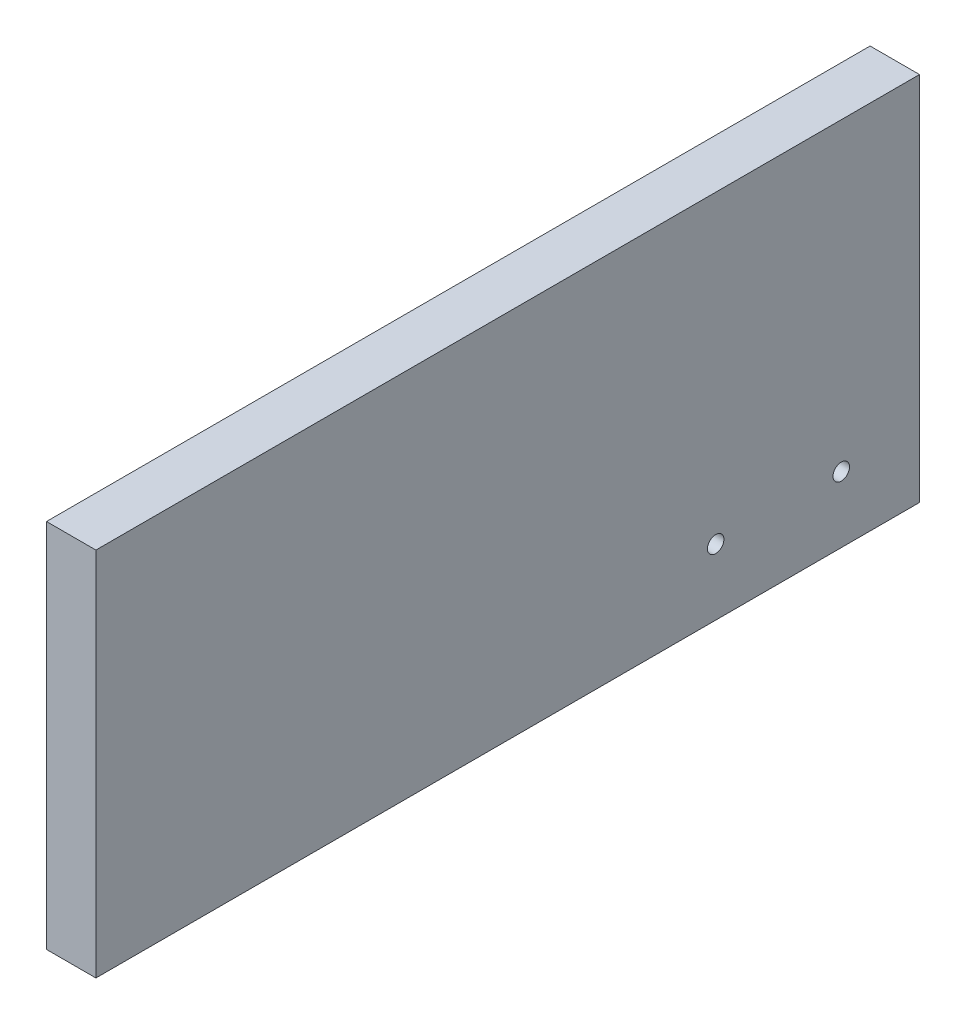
ISO-10303-21;
HEADER;
FILE_DESCRIPTION(('STEP AP214'),'2;1');
FILE_NAME('part.step','',(''),(''),'','','');
FILE_SCHEMA(('AUTOMOTIVE_DESIGN { 1 0 10303 214 1 1 1 1 }'));
ENDSEC;
DATA;
#1=APPLICATION_CONTEXT('core data for automotive mechanical design processes');
#2=APPLICATION_PROTOCOL_DEFINITION('international standard','automotive_design',2000,#1);
#3=PRODUCT_CONTEXT('',#1,'mechanical');
#4=PRODUCT('Part','Part','',(#3));
#5=PRODUCT_RELATED_PRODUCT_CATEGORY('part','',(#4));
#6=PRODUCT_DEFINITION_FORMATION('','',#4);
#7=PRODUCT_DEFINITION_CONTEXT('part definition',#1,'design');
#8=PRODUCT_DEFINITION('design','',#6,#7);
#9=PRODUCT_DEFINITION_SHAPE('','',#8);
#10=(LENGTH_UNIT() NAMED_UNIT(*) SI_UNIT(.MILLI.,.METRE.));
#11=(NAMED_UNIT(*) PLANE_ANGLE_UNIT() SI_UNIT($,.RADIAN.));
#12=(NAMED_UNIT(*) SI_UNIT($,.STERADIAN.) SOLID_ANGLE_UNIT());
#13=UNCERTAINTY_MEASURE_WITH_UNIT(LENGTH_MEASURE(1.E-05),#10,'distance_accuracy_value','');
#14=(GEOMETRIC_REPRESENTATION_CONTEXT(3) GLOBAL_UNCERTAINTY_ASSIGNED_CONTEXT((#13)) GLOBAL_UNIT_ASSIGNED_CONTEXT((#10,
#11,#12)) REPRESENTATION_CONTEXT('',''));
#15=CARTESIAN_POINT('',(0.,0.,0.));
#16=DIRECTION('',(0.,0.,1.));
#17=DIRECTION('',(1.,0.,0.));
#18=AXIS2_PLACEMENT_3D('',#15,#16,#17);
#19=CARTESIAN_POINT('',(0.,0.,635.));
#20=DIRECTION('',(1.,0.,0.));
#21=DIRECTION('',(0.,0.,-1.));
#22=AXIS2_PLACEMENT_3D('',#19,#20,#21);
#23=PLANE('',#22);
#24=CARTESIAN_POINT('',(0.,50.8,157.162500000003));
#25=DIRECTION('',(1.,0.,0.));
#26=DIRECTION('',(0.,1.,0.));
#27=AXIS2_PLACEMENT_3D('',#24,#25,#26);
#28=CIRCLE('',#27,6.35);
#29=CARTESIAN_POINT('',(0.,57.15,157.162500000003));
#30=VERTEX_POINT('',#29);
#31=EDGE_CURVE('E105',#30,#30,#28,.T.);
#32=ORIENTED_EDGE('',*,*,#31,.T.);
#33=EDGE_LOOP('',(#32));
#34=FACE_BOUND('',#33,.T.);
#35=CARTESIAN_POINT('',(0.,50.8,60.3250000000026));
#36=DIRECTION('',(1.,0.,0.));
#37=DIRECTION('',(0.,1.,0.));
#38=AXIS2_PLACEMENT_3D('',#35,#36,#37);
#39=CIRCLE('',#38,6.35000000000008);
#40=CARTESIAN_POINT('',(0.,57.15,60.3250000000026));
#41=VERTEX_POINT('',#40);
#42=EDGE_CURVE('E116',#41,#41,#39,.T.);
#43=ORIENTED_EDGE('',*,*,#42,.T.);
#44=EDGE_LOOP('',(#43));
#45=FACE_BOUND('',#44,.T.);
#46=DIRECTION('',(0.,-1.,0.));
#47=VECTOR('',#46,1.);
#48=CARTESIAN_POINT('',(0.,0.,0.));
#49=LINE('',#48,#47);
#50=CARTESIAN_POINT('',(0.,285.75,0.));
#51=VERTEX_POINT('',#50);
#52=CARTESIAN_POINT('',(0.,0.,0.));
#53=VERTEX_POINT('',#52);
#54=EDGE_CURVE('E102',#51,#53,#49,.T.);
#55=ORIENTED_EDGE('',*,*,#54,.T.);
#56=DIRECTION('',(0.,0.,-1.));
#57=VECTOR('',#56,1.);
#58=CARTESIAN_POINT('',(0.,0.,635.));
#59=LINE('',#58,#57);
#60=CARTESIAN_POINT('',(0.,0.,635.));
#61=VERTEX_POINT('',#60);
#62=EDGE_CURVE('E11',#61,#53,#59,.T.);
#63=ORIENTED_EDGE('',*,*,#62,.F.);
#64=DIRECTION('',(0.,-1.,0.));
#65=VECTOR('',#64,1.);
#66=CARTESIAN_POINT('',(0.,0.,635.));
#67=LINE('',#66,#65);
#68=CARTESIAN_POINT('',(0.,285.75,635.));
#69=VERTEX_POINT('',#68);
#70=EDGE_CURVE('E90',#69,#61,#67,.T.);
#71=ORIENTED_EDGE('',*,*,#70,.F.);
#72=DIRECTION('',(0.,0.,-1.));
#73=VECTOR('',#72,1.);
#74=CARTESIAN_POINT('',(0.,285.75,635.));
#75=LINE('',#74,#73);
#76=EDGE_CURVE('E98',#69,#51,#75,.T.);
#77=ORIENTED_EDGE('',*,*,#76,.T.);
#78=EDGE_LOOP('',(#55,#63,#71,#77));
#79=FACE_BOUND('',#78,.T.);
#80=ADVANCED_FACE('F39',(#34,#45,#79),#23,.F.);
#81=CARTESIAN_POINT('',(0.,0.,635.));
#82=DIRECTION('',(0.,1.,0.));
#83=DIRECTION('',(0.,0.,1.));
#84=AXIS2_PLACEMENT_3D('',#81,#82,#83);
#85=PLANE('',#84);
#86=DIRECTION('',(1.,0.,0.));
#87=VECTOR('',#86,1.);
#88=CARTESIAN_POINT('',(0.,0.,0.));
#89=LINE('',#88,#87);
#90=CARTESIAN_POINT('',(38.1,0.,0.));
#91=VERTEX_POINT('',#90);
#92=EDGE_CURVE('E94',#53,#91,#89,.T.);
#93=ORIENTED_EDGE('',*,*,#92,.T.);
#94=DIRECTION('',(0.,0.,-1.));
#95=VECTOR('',#94,1.);
#96=CARTESIAN_POINT('',(38.1,0.,635.));
#97=LINE('',#96,#95);
#98=CARTESIAN_POINT('',(38.1,0.,635.));
#99=VERTEX_POINT('',#98);
#100=EDGE_CURVE('E47',#99,#91,#97,.T.);
#101=ORIENTED_EDGE('',*,*,#100,.F.);
#102=DIRECTION('',(1.,0.,0.));
#103=VECTOR('',#102,1.);
#104=CARTESIAN_POINT('',(0.,0.,635.));
#105=LINE('',#104,#103);
#106=EDGE_CURVE('E85',#61,#99,#105,.T.);
#107=ORIENTED_EDGE('',*,*,#106,.F.);
#108=ORIENTED_EDGE('',*,*,#62,.T.);
#109=EDGE_LOOP('',(#93,#101,#107,#108));
#110=FACE_BOUND('',#109,.T.);
#111=ADVANCED_FACE('F93',(#110),#85,.F.);
#112=CARTESIAN_POINT('',(38.1,0.,635.));
#113=DIRECTION('',(-1.,0.,0.));
#114=DIRECTION('',(0.,-1.,0.));
#115=AXIS2_PLACEMENT_3D('',#112,#113,#114);
#116=PLANE('',#115);
#117=CARTESIAN_POINT('',(38.1,50.8,157.162500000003));
#118=DIRECTION('',(1.,0.,0.));
#119=DIRECTION('',(0.,1.,0.));
#120=AXIS2_PLACEMENT_3D('',#117,#118,#119);
#121=CIRCLE('',#120,6.35);
#122=CARTESIAN_POINT('',(38.1,57.15,157.162500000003));
#123=VERTEX_POINT('',#122);
#124=EDGE_CURVE('E122',#123,#123,#121,.T.);
#125=ORIENTED_EDGE('',*,*,#124,.F.);
#126=EDGE_LOOP('',(#125));
#127=FACE_BOUND('',#126,.T.);
#128=CARTESIAN_POINT('',(38.1,50.8,60.3250000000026));
#129=DIRECTION('',(1.,0.,0.));
#130=DIRECTION('',(0.,1.,0.));
#131=AXIS2_PLACEMENT_3D('',#128,#129,#130);
#132=CIRCLE('',#131,6.35000000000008);
#133=CARTESIAN_POINT('',(38.1,57.15,60.3250000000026));
#134=VERTEX_POINT('',#133);
#135=EDGE_CURVE('E119',#134,#134,#132,.T.);
#136=ORIENTED_EDGE('',*,*,#135,.F.);
#137=EDGE_LOOP('',(#136));
#138=FACE_BOUND('',#137,.T.);
#139=DIRECTION('',(0.,1.,0.));
#140=VECTOR('',#139,1.);
#141=CARTESIAN_POINT('',(38.1,0.,0.));
#142=LINE('',#141,#140);
#143=CARTESIAN_POINT('',(38.1,285.75,0.));
#144=VERTEX_POINT('',#143);
#145=EDGE_CURVE('E72',#91,#144,#142,.T.);
#146=ORIENTED_EDGE('',*,*,#145,.T.);
#147=DIRECTION('',(0.,0.,-1.));
#148=VECTOR('',#147,1.);
#149=CARTESIAN_POINT('',(38.1,285.75,635.));
#150=LINE('',#149,#148);
#151=CARTESIAN_POINT('',(38.1,285.75,635.));
#152=VERTEX_POINT('',#151);
#153=EDGE_CURVE('E95',#152,#144,#150,.T.);
#154=ORIENTED_EDGE('',*,*,#153,.F.);
#155=DIRECTION('',(0.,1.,0.));
#156=VECTOR('',#155,1.);
#157=CARTESIAN_POINT('',(38.1,0.,635.));
#158=LINE('',#157,#156);
#159=EDGE_CURVE('E88',#99,#152,#158,.T.);
#160=ORIENTED_EDGE('',*,*,#159,.F.);
#161=ORIENTED_EDGE('',*,*,#100,.T.);
#162=EDGE_LOOP('',(#146,#154,#160,#161));
#163=FACE_BOUND('',#162,.T.);
#164=ADVANCED_FACE('F96',(#127,#138,#163),#116,.F.);
#165=CARTESIAN_POINT('',(0.,285.75,635.));
#166=DIRECTION('',(0.,-1.,0.));
#167=DIRECTION('',(0.,0.,-1.));
#168=AXIS2_PLACEMENT_3D('',#165,#166,#167);
#169=PLANE('',#168);
#170=DIRECTION('',(-1.,0.,0.));
#171=VECTOR('',#170,1.);
#172=CARTESIAN_POINT('',(0.,285.75,0.));
#173=LINE('',#172,#171);
#174=EDGE_CURVE('E78',#144,#51,#173,.T.);
#175=ORIENTED_EDGE('',*,*,#174,.T.);
#176=ORIENTED_EDGE('',*,*,#76,.F.);
#177=DIRECTION('',(-1.,0.,0.));
#178=VECTOR('',#177,1.);
#179=CARTESIAN_POINT('',(0.,285.75,635.));
#180=LINE('',#179,#178);
#181=EDGE_CURVE('E55',#152,#69,#180,.T.);
#182=ORIENTED_EDGE('',*,*,#181,.F.);
#183=ORIENTED_EDGE('',*,*,#153,.T.);
#184=EDGE_LOOP('',(#175,#176,#182,#183));
#185=FACE_BOUND('',#184,.T.);
#186=ADVANCED_FACE('F110',(#185),#169,.F.);
#187=CARTESIAN_POINT('',(0.,0.,635.));
#188=DIRECTION('',(0.,0.,-1.));
#189=DIRECTION('',(-1.,0.,0.));
#190=AXIS2_PLACEMENT_3D('',#187,#188,#189);
#191=PLANE('',#190);
#192=ORIENTED_EDGE('',*,*,#70,.T.);
#193=ORIENTED_EDGE('',*,*,#106,.T.);
#194=ORIENTED_EDGE('',*,*,#159,.T.);
#195=ORIENTED_EDGE('',*,*,#181,.T.);
#196=EDGE_LOOP('',(#192,#193,#194,#195));
#197=FACE_BOUND('',#196,.T.);
#198=ADVANCED_FACE('F86',(#197),#191,.F.);
#199=CARTESIAN_POINT('',(0.,0.,0.));
#200=DIRECTION('',(0.,0.,-1.));
#201=DIRECTION('',(-1.,0.,0.));
#202=AXIS2_PLACEMENT_3D('',#199,#200,#201);
#203=PLANE('',#202);
#204=ORIENTED_EDGE('',*,*,#54,.F.);
#205=ORIENTED_EDGE('',*,*,#174,.F.);
#206=ORIENTED_EDGE('',*,*,#145,.F.);
#207=ORIENTED_EDGE('',*,*,#92,.F.);
#208=EDGE_LOOP('',(#204,#205,#206,#207));
#209=FACE_BOUND('',#208,.T.);
#210=ADVANCED_FACE('F113',(#209),#203,.T.);
#211=CARTESIAN_POINT('',(0.,50.8,60.3250000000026));
#212=DIRECTION('',(1.,0.,0.));
#213=DIRECTION('',(0.,1.,0.));
#214=AXIS2_PLACEMENT_3D('',#211,#212,#213);
#215=CYLINDRICAL_SURFACE('',#214,6.35000000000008);
#216=CARTESIAN_POINT('',(0.,57.15,60.3250000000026));
#217=CARTESIAN_POINT('',(0.396874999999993,57.15,60.3250000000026));
#218=CARTESIAN_POINT('',(0.793749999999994,57.15,60.3250000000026));
#219=CARTESIAN_POINT('',(1.58749999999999,57.15,60.3250000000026));
#220=CARTESIAN_POINT('',(1.98437499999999,57.15,60.3250000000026));
#221=CARTESIAN_POINT('',(2.77812499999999,57.15,60.3250000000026));
#222=CARTESIAN_POINT('',(3.17499999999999,57.15,60.3250000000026));
#223=CARTESIAN_POINT('',(3.96874999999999,57.15,60.3250000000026));
#224=CARTESIAN_POINT('',(4.36562499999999,57.15,60.3250000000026));
#225=CARTESIAN_POINT('',(5.15937499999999,57.15,60.3250000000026));
#226=CARTESIAN_POINT('',(5.55624999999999,57.15,60.3250000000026));
#227=CARTESIAN_POINT('',(6.34999999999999,57.15,60.3250000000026));
#228=CARTESIAN_POINT('',(6.74687499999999,57.15,60.3250000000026));
#229=CARTESIAN_POINT('',(7.54062499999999,57.15,60.3250000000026));
#230=CARTESIAN_POINT('',(7.93749999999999,57.15,60.3250000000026));
#231=CARTESIAN_POINT('',(8.73124999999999,57.15,60.3250000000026));
#232=CARTESIAN_POINT('',(9.12812499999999,57.15,60.3250000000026));
#233=CARTESIAN_POINT('',(9.92187499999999,57.15,60.3250000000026));
#234=CARTESIAN_POINT('',(10.31875,57.15,60.3250000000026));
#235=CARTESIAN_POINT('',(11.1125,57.15,60.3250000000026));
#236=CARTESIAN_POINT('',(11.509375,57.15,60.3250000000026));
#237=CARTESIAN_POINT('',(12.303125,57.15,60.3250000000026));
#238=CARTESIAN_POINT('',(12.7,57.15,60.3250000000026));
#239=CARTESIAN_POINT('',(13.49375,57.15,60.3250000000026));
#240=CARTESIAN_POINT('',(13.890625,57.15,60.3250000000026));
#241=CARTESIAN_POINT('',(14.684375,57.15,60.3250000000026));
#242=CARTESIAN_POINT('',(15.08125,57.15,60.3250000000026));
#243=CARTESIAN_POINT('',(15.875,57.15,60.3250000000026));
#244=CARTESIAN_POINT('',(16.271875,57.15,60.3250000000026));
#245=CARTESIAN_POINT('',(17.065625,57.15,60.3250000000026));
#246=CARTESIAN_POINT('',(17.4625,57.15,60.3250000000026));
#247=CARTESIAN_POINT('',(18.25625,57.15,60.3250000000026));
#248=CARTESIAN_POINT('',(18.653125,57.15,60.3250000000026));
#249=CARTESIAN_POINT('',(19.446875,57.15,60.3250000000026));
#250=CARTESIAN_POINT('',(19.84375,57.15,60.3250000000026));
#251=CARTESIAN_POINT('',(20.6375,57.15,60.3250000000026));
#252=CARTESIAN_POINT('',(21.034375,57.15,60.3250000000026));
#253=CARTESIAN_POINT('',(21.828125,57.15,60.3250000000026));
#254=CARTESIAN_POINT('',(22.225,57.15,60.3250000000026));
#255=CARTESIAN_POINT('',(23.01875,57.15,60.3250000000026));
#256=CARTESIAN_POINT('',(23.415625,57.15,60.3250000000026));
#257=CARTESIAN_POINT('',(24.209375,57.15,60.3250000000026));
#258=CARTESIAN_POINT('',(24.60625,57.15,60.3250000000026));
#259=CARTESIAN_POINT('',(25.4,57.15,60.3250000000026));
#260=CARTESIAN_POINT('',(25.796875,57.15,60.3250000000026));
#261=CARTESIAN_POINT('',(26.590625,57.15,60.3250000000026));
#262=CARTESIAN_POINT('',(26.9875,57.15,60.3250000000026));
#263=CARTESIAN_POINT('',(27.78125,57.15,60.3250000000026));
#264=CARTESIAN_POINT('',(28.178125,57.15,60.3250000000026));
#265=CARTESIAN_POINT('',(28.971875,57.15,60.3250000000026));
#266=CARTESIAN_POINT('',(29.36875,57.15,60.3250000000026));
#267=CARTESIAN_POINT('',(30.1625,57.15,60.3250000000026));
#268=CARTESIAN_POINT('',(30.559375,57.15,60.3250000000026));
#269=CARTESIAN_POINT('',(31.353125,57.15,60.3250000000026));
#270=CARTESIAN_POINT('',(31.75,57.15,60.3250000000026));
#271=CARTESIAN_POINT('',(32.54375,57.15,60.3250000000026));
#272=CARTESIAN_POINT('',(32.940625,57.15,60.3250000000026));
#273=CARTESIAN_POINT('',(33.734375,57.15,60.3250000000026));
#274=CARTESIAN_POINT('',(34.13125,57.15,60.3250000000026));
#275=CARTESIAN_POINT('',(34.925,57.15,60.3250000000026));
#276=CARTESIAN_POINT('',(35.321875,57.15,60.3250000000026));
#277=CARTESIAN_POINT('',(36.115625,57.15,60.3250000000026));
#278=CARTESIAN_POINT('',(36.5125,57.15,60.3250000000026));
#279=CARTESIAN_POINT('',(37.30625,57.15,60.3250000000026));
#280=CARTESIAN_POINT('',(37.703125,57.15,60.3250000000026));
#281=CARTESIAN_POINT('',(38.1,57.15,60.3250000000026));
#282=B_SPLINE_CURVE_WITH_KNOTS('',3,(#216,#217,#218,#219,#220,#221,#222,#223,#224,#225,#226,
#227,#228,#229,#230,#231,#232,#233,#234,#235,#236,#237,#238,#239,#240,#241,#242,#243,#244,#245,
#246,#247,#248,#249,#250,#251,#252,#253,#254,#255,#256,#257,#258,#259,#260,#261,#262,#263,#264,
#265,#266,#267,#268,#269,#270,#271,#272,#273,#274,#275,#276,#277,#278,#279,#280,#281),
.UNSPECIFIED.,.F.,.F.,(4,2,2,2,2,2,2,2,2,2,2,2,2,2,2,2,2,2,2,2,2,2,2,2,2,2,2,2,2,2,2,2,4),(0.,
1.190625,2.38125,3.571875,4.7625,5.953125,7.14375,8.334375,9.525,10.715625,11.90625,13.096875,
14.2875,15.478125,16.66875,17.859375,19.05,20.240625,21.43125,22.621875,23.8125,25.003125,
26.19375,27.384375,28.575,29.765625,30.95625,32.146875,33.3375,34.528125,35.71875,36.909375,
38.1),.UNSPECIFIED.);
#283=EDGE_CURVE('BSEAM133',#41,#134,#282,.T.);
#284=ORIENTED_EDGE('',*,*,#42,.F.);
#285=ORIENTED_EDGE('',*,*,#135,.T.);
#286=ORIENTED_EDGE('',*,*,#283,.T.);
#287=ORIENTED_EDGE('',*,*,#283,.F.);
#288=EDGE_LOOP('',(#284,#286,#285,#287));
#289=FACE_BOUND('',#288,.T.);
#290=ADVANCED_FACE('F133',(#289),#215,.F.);
#291=CARTESIAN_POINT('',(0.,50.8,157.162500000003));
#292=DIRECTION('',(1.,0.,0.));
#293=DIRECTION('',(0.,1.,0.));
#294=AXIS2_PLACEMENT_3D('',#291,#292,#293);
#295=CYLINDRICAL_SURFACE('',#294,6.35);
#296=CARTESIAN_POINT('',(0.,57.15,157.162500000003));
#297=CARTESIAN_POINT('',(0.396874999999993,57.15,157.162500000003));
#298=CARTESIAN_POINT('',(0.793749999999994,57.15,157.162500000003));
#299=CARTESIAN_POINT('',(1.58749999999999,57.15,157.162500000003));
#300=CARTESIAN_POINT('',(1.98437499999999,57.15,157.162500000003));
#301=CARTESIAN_POINT('',(2.77812499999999,57.15,157.162500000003));
#302=CARTESIAN_POINT('',(3.17499999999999,57.15,157.162500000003));
#303=CARTESIAN_POINT('',(3.96874999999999,57.15,157.162500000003));
#304=CARTESIAN_POINT('',(4.36562499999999,57.15,157.162500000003));
#305=CARTESIAN_POINT('',(5.15937499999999,57.15,157.162500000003));
#306=CARTESIAN_POINT('',(5.55624999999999,57.15,157.162500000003));
#307=CARTESIAN_POINT('',(6.34999999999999,57.15,157.162500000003));
#308=CARTESIAN_POINT('',(6.74687499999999,57.15,157.162500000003));
#309=CARTESIAN_POINT('',(7.54062499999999,57.15,157.162500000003));
#310=CARTESIAN_POINT('',(7.93749999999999,57.15,157.162500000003));
#311=CARTESIAN_POINT('',(8.73124999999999,57.15,157.162500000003));
#312=CARTESIAN_POINT('',(9.12812499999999,57.15,157.162500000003));
#313=CARTESIAN_POINT('',(9.92187499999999,57.15,157.162500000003));
#314=CARTESIAN_POINT('',(10.31875,57.15,157.162500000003));
#315=CARTESIAN_POINT('',(11.1125,57.15,157.162500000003));
#316=CARTESIAN_POINT('',(11.509375,57.15,157.162500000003));
#317=CARTESIAN_POINT('',(12.303125,57.15,157.162500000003));
#318=CARTESIAN_POINT('',(12.7,57.15,157.162500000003));
#319=CARTESIAN_POINT('',(13.49375,57.15,157.162500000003));
#320=CARTESIAN_POINT('',(13.890625,57.15,157.162500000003));
#321=CARTESIAN_POINT('',(14.684375,57.15,157.162500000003));
#322=CARTESIAN_POINT('',(15.08125,57.15,157.162500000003));
#323=CARTESIAN_POINT('',(15.875,57.15,157.162500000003));
#324=CARTESIAN_POINT('',(16.271875,57.15,157.162500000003));
#325=CARTESIAN_POINT('',(17.065625,57.15,157.162500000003));
#326=CARTESIAN_POINT('',(17.4625,57.15,157.162500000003));
#327=CARTESIAN_POINT('',(18.25625,57.15,157.162500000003));
#328=CARTESIAN_POINT('',(18.653125,57.15,157.162500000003));
#329=CARTESIAN_POINT('',(19.446875,57.15,157.162500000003));
#330=CARTESIAN_POINT('',(19.84375,57.15,157.162500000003));
#331=CARTESIAN_POINT('',(20.6375,57.15,157.162500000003));
#332=CARTESIAN_POINT('',(21.034375,57.15,157.162500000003));
#333=CARTESIAN_POINT('',(21.828125,57.15,157.162500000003));
#334=CARTESIAN_POINT('',(22.225,57.15,157.162500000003));
#335=CARTESIAN_POINT('',(23.01875,57.15,157.162500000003));
#336=CARTESIAN_POINT('',(23.415625,57.15,157.162500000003));
#337=CARTESIAN_POINT('',(24.209375,57.15,157.162500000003));
#338=CARTESIAN_POINT('',(24.60625,57.15,157.162500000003));
#339=CARTESIAN_POINT('',(25.4,57.15,157.162500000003));
#340=CARTESIAN_POINT('',(25.796875,57.15,157.162500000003));
#341=CARTESIAN_POINT('',(26.590625,57.15,157.162500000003));
#342=CARTESIAN_POINT('',(26.9875,57.15,157.162500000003));
#343=CARTESIAN_POINT('',(27.78125,57.15,157.162500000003));
#344=CARTESIAN_POINT('',(28.178125,57.15,157.162500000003));
#345=CARTESIAN_POINT('',(28.971875,57.15,157.162500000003));
#346=CARTESIAN_POINT('',(29.36875,57.15,157.162500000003));
#347=CARTESIAN_POINT('',(30.1625,57.15,157.162500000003));
#348=CARTESIAN_POINT('',(30.559375,57.15,157.162500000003));
#349=CARTESIAN_POINT('',(31.353125,57.15,157.162500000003));
#350=CARTESIAN_POINT('',(31.75,57.15,157.162500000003));
#351=CARTESIAN_POINT('',(32.54375,57.15,157.162500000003));
#352=CARTESIAN_POINT('',(32.940625,57.15,157.162500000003));
#353=CARTESIAN_POINT('',(33.734375,57.15,157.162500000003));
#354=CARTESIAN_POINT('',(34.13125,57.15,157.162500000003));
#355=CARTESIAN_POINT('',(34.925,57.15,157.162500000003));
#356=CARTESIAN_POINT('',(35.321875,57.15,157.162500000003));
#357=CARTESIAN_POINT('',(36.115625,57.15,157.162500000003));
#358=CARTESIAN_POINT('',(36.5125,57.15,157.162500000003));
#359=CARTESIAN_POINT('',(37.30625,57.15,157.162500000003));
#360=CARTESIAN_POINT('',(37.703125,57.15,157.162500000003));
#361=CARTESIAN_POINT('',(38.1,57.15,157.162500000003));
#362=B_SPLINE_CURVE_WITH_KNOTS('',3,(#296,#297,#298,#299,#300,#301,#302,#303,#304,#305,#306,
#307,#308,#309,#310,#311,#312,#313,#314,#315,#316,#317,#318,#319,#320,#321,#322,#323,#324,#325,
#326,#327,#328,#329,#330,#331,#332,#333,#334,#335,#336,#337,#338,#339,#340,#341,#342,#343,#344,
#345,#346,#347,#348,#349,#350,#351,#352,#353,#354,#355,#356,#357,#358,#359,#360,#361),
.UNSPECIFIED.,.F.,.F.,(4,2,2,2,2,2,2,2,2,2,2,2,2,2,2,2,2,2,2,2,2,2,2,2,2,2,2,2,2,2,2,2,4),(0.,
1.190625,2.38125,3.571875,4.7625,5.953125,7.14375,8.334375,9.525,10.715625,11.90625,13.096875,
14.2875,15.478125,16.66875,17.859375,19.05,20.240625,21.43125,22.621875,23.8125,25.003125,
26.19375,27.384375,28.575,29.765625,30.95625,32.146875,33.3375,34.528125,35.71875,36.909375,
38.1),.UNSPECIFIED.);
#363=EDGE_CURVE('BSEAM130',#30,#123,#362,.T.);
#364=ORIENTED_EDGE('',*,*,#31,.F.);
#365=ORIENTED_EDGE('',*,*,#124,.T.);
#366=ORIENTED_EDGE('',*,*,#363,.T.);
#367=ORIENTED_EDGE('',*,*,#363,.F.);
#368=EDGE_LOOP('',(#364,#366,#365,#367));
#369=FACE_BOUND('',#368,.T.);
#370=ADVANCED_FACE('F130',(#369),#295,.F.);
#371=CLOSED_SHELL('',(#80,#111,#164,#186,#198,#210,#290,#370));
#372=MANIFOLD_SOLID_BREP('B2',#371);
#373=ADVANCED_BREP_SHAPE_REPRESENTATION('',(#18,#372),#14);
#374=SHAPE_DEFINITION_REPRESENTATION(#9,#373);
ENDSEC;
END-ISO-10303-21;
